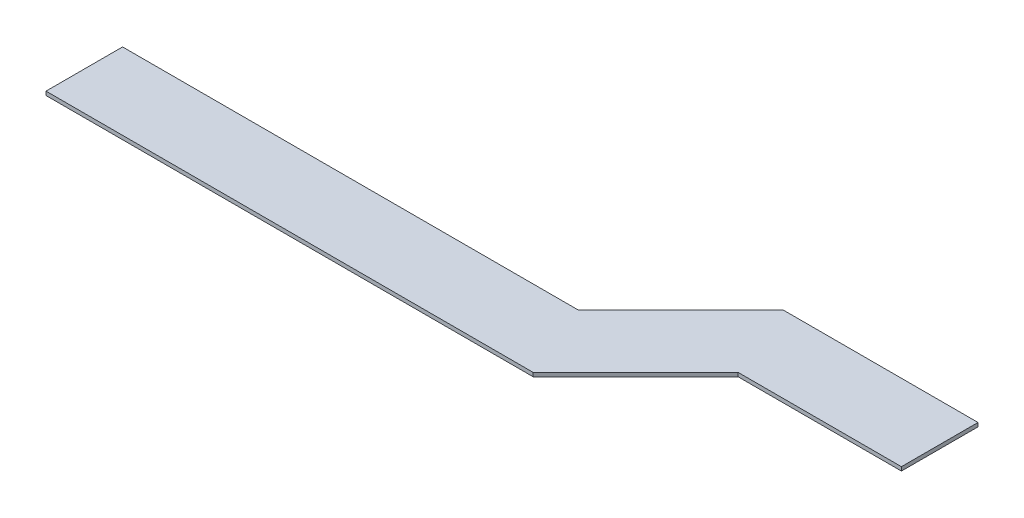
from build123d import *

# Parameters (mm, degrees)
EXTRUSION1_DEPTH = 3


with BuildPart() as part:
    # Esquisse1 → Extrusion1 (new body)
    with BuildSketch(Plane(origin=(0, 0, 0), x_dir=(1, 0, 0), z_dir=(0, 1, 0))):
        Polygon((0, 0), (0, -60), (-128, -60), (-208.3, -140.3), (-590, -140.3), (-590, -80.3), (-233.2, -80.3), (-152.9, 0), align=None)
    extrude(amount=EXTRUSION1_DEPTH)


solid = part.part
